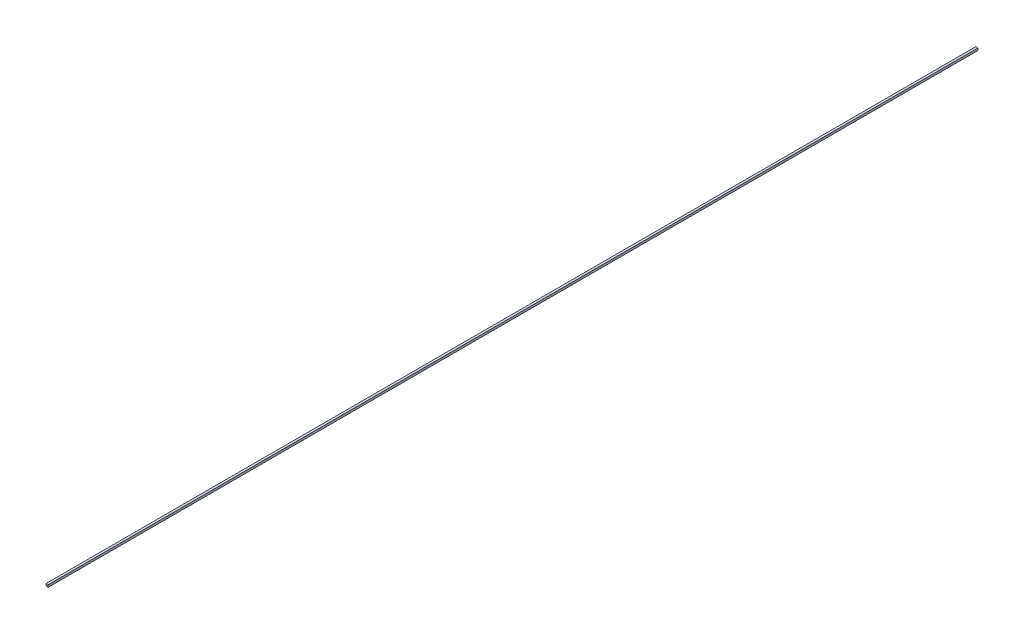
ISO-10303-21;
HEADER;
FILE_DESCRIPTION(('STEP AP214'),'2;1');
FILE_NAME('part.step','',(''),(''),'','','');
FILE_SCHEMA(('AUTOMOTIVE_DESIGN { 1 0 10303 214 1 1 1 1 }'));
ENDSEC;
DATA;
#1=APPLICATION_CONTEXT('core data for automotive mechanical design processes');
#2=APPLICATION_PROTOCOL_DEFINITION('international standard','automotive_design',2000,#1);
#3=PRODUCT_CONTEXT('',#1,'mechanical');
#4=PRODUCT('Part','Part','',(#3));
#5=PRODUCT_RELATED_PRODUCT_CATEGORY('part','',(#4));
#6=PRODUCT_DEFINITION_FORMATION('','',#4);
#7=PRODUCT_DEFINITION_CONTEXT('part definition',#1,'design');
#8=PRODUCT_DEFINITION('design','',#6,#7);
#9=PRODUCT_DEFINITION_SHAPE('','',#8);
#10=(LENGTH_UNIT() NAMED_UNIT(*) SI_UNIT(.MILLI.,.METRE.));
#11=(NAMED_UNIT(*) PLANE_ANGLE_UNIT() SI_UNIT($,.RADIAN.));
#12=(NAMED_UNIT(*) SI_UNIT($,.STERADIAN.) SOLID_ANGLE_UNIT());
#13=UNCERTAINTY_MEASURE_WITH_UNIT(LENGTH_MEASURE(1.E-05),#10,'distance_accuracy_value','');
#14=(GEOMETRIC_REPRESENTATION_CONTEXT(3) GLOBAL_UNCERTAINTY_ASSIGNED_CONTEXT((#13)) GLOBAL_UNIT_ASSIGNED_CONTEXT((#10,
#11,#12)) REPRESENTATION_CONTEXT('',''));
#15=CARTESIAN_POINT('',(0.,0.,0.));
#16=DIRECTION('',(0.,0.,1.));
#17=DIRECTION('',(1.,0.,0.));
#18=AXIS2_PLACEMENT_3D('',#15,#16,#17);
#19=CARTESIAN_POINT('',(0.00100076,0.00100076,0.));
#20=DIRECTION('',(1.,0.,0.));
#21=DIRECTION('',(0.,0.,-1.));
#22=AXIS2_PLACEMENT_3D('',#19,#20,#21);
#23=PLANE('',#22);
#24=DIRECTION('',(0.,0.,-1.));
#25=VECTOR('',#24,1.);
#26=CARTESIAN_POINT('',(0.00100076,0.,0.));
#27=LINE('',#26,#25);
#28=CARTESIAN_POINT('',(0.00100076,0.,0.));
#29=VERTEX_POINT('',#28);
#30=CARTESIAN_POINT('',(0.00100076,0.,0.41656));
#31=VERTEX_POINT('',#30);
#32=EDGE_CURVE('E61',#29,#31,#27,.F.);
#33=ORIENTED_EDGE('',*,*,#32,.F.);
#34=DIRECTION('',(0.,1.,0.));
#35=VECTOR('',#34,1.);
#36=CARTESIAN_POINT('',(0.00100076,0.00100076,0.));
#37=LINE('',#36,#35);
#38=CARTESIAN_POINT('',(0.00100076,0.00100076,0.));
#39=VERTEX_POINT('',#38);
#40=EDGE_CURVE('E75',#29,#39,#37,.T.);
#41=ORIENTED_EDGE('',*,*,#40,.T.);
#42=DIRECTION('',(0.,0.,1.));
#43=VECTOR('',#42,1.);
#44=CARTESIAN_POINT('',(0.00100076,0.00100076,0.));
#45=LINE('',#44,#43);
#46=CARTESIAN_POINT('',(0.00100076,0.00100076,0.41656));
#47=VERTEX_POINT('',#46);
#48=EDGE_CURVE('E79',#47,#39,#45,.F.);
#49=ORIENTED_EDGE('',*,*,#48,.F.);
#50=DIRECTION('',(0.,1.,0.));
#51=VECTOR('',#50,1.);
#52=CARTESIAN_POINT('',(0.00100076,0.,0.41656));
#53=LINE('',#52,#51);
#54=EDGE_CURVE('E64',#31,#47,#53,.T.);
#55=ORIENTED_EDGE('',*,*,#54,.F.);
#56=EDGE_LOOP('',(#33,#41,#49,#55));
#57=FACE_BOUND('',#56,.T.);
#58=ADVANCED_FACE('F16',(#57),#23,.T.);
#59=CARTESIAN_POINT('',(0.00100076,0.,0.));
#60=DIRECTION('',(0.,-1.,0.));
#61=DIRECTION('',(0.,0.,-1.));
#62=AXIS2_PLACEMENT_3D('',#59,#60,#61);
#63=PLANE('',#62);
#64=DIRECTION('',(0.,0.,1.));
#65=VECTOR('',#64,1.);
#66=CARTESIAN_POINT('',(0.,0.,0.));
#67=LINE('',#66,#65);
#68=CARTESIAN_POINT('',(0.,0.,0.));
#69=VERTEX_POINT('',#68);
#70=CARTESIAN_POINT('',(0.,0.,0.41656));
#71=VERTEX_POINT('',#70);
#72=EDGE_CURVE('E59',#69,#71,#67,.T.);
#73=ORIENTED_EDGE('',*,*,#72,.F.);
#74=DIRECTION('',(1.,0.,0.));
#75=VECTOR('',#74,1.);
#76=CARTESIAN_POINT('',(0.00100076,0.,0.));
#77=LINE('',#76,#75);
#78=EDGE_CURVE('E81',#69,#29,#77,.T.);
#79=ORIENTED_EDGE('',*,*,#78,.T.);
#80=ORIENTED_EDGE('',*,*,#32,.T.);
#81=DIRECTION('',(1.,0.,0.));
#82=VECTOR('',#81,1.);
#83=CARTESIAN_POINT('',(0.,0.,0.41656));
#84=LINE('',#83,#82);
#85=EDGE_CURVE('E19',#71,#31,#84,.T.);
#86=ORIENTED_EDGE('',*,*,#85,.F.);
#87=EDGE_LOOP('',(#73,#79,#80,#86));
#88=FACE_BOUND('',#87,.T.);
#89=ADVANCED_FACE('F56',(#88),#63,.T.);
#90=CARTESIAN_POINT('',(0.,0.,0.41656));
#91=DIRECTION('',(0.,0.,1.));
#92=DIRECTION('',(1.,0.,0.));
#93=AXIS2_PLACEMENT_3D('',#90,#91,#92);
#94=PLANE('',#93);
#95=DIRECTION('',(1.,0.,0.));
#96=VECTOR('',#95,1.);
#97=CARTESIAN_POINT('',(0.,0.00100076,0.41656));
#98=LINE('',#97,#96);
#99=CARTESIAN_POINT('',(0.,0.00100076,0.41656));
#100=VERTEX_POINT('',#99);
#101=EDGE_CURVE('E69',#100,#47,#98,.T.);
#102=ORIENTED_EDGE('',*,*,#101,.F.);
#103=DIRECTION('',(0.,1.,0.));
#104=VECTOR('',#103,1.);
#105=CARTESIAN_POINT('',(0.,0.,0.41656));
#106=LINE('',#105,#104);
#107=EDGE_CURVE('E66',#71,#100,#106,.T.);
#108=ORIENTED_EDGE('',*,*,#107,.F.);
#109=ORIENTED_EDGE('',*,*,#85,.T.);
#110=ORIENTED_EDGE('',*,*,#54,.T.);
#111=EDGE_LOOP('',(#102,#108,#109,#110));
#112=FACE_BOUND('',#111,.T.);
#113=ADVANCED_FACE('F67',(#112),#94,.T.);
#114=CARTESIAN_POINT('',(0.,0.00100076,0.));
#115=DIRECTION('',(0.,1.,0.));
#116=DIRECTION('',(0.,0.,1.));
#117=AXIS2_PLACEMENT_3D('',#114,#115,#116);
#118=PLANE('',#117);
#119=ORIENTED_EDGE('',*,*,#48,.T.);
#120=DIRECTION('',(1.,0.,0.));
#121=VECTOR('',#120,1.);
#122=CARTESIAN_POINT('',(0.,0.00100076,0.));
#123=LINE('',#122,#121);
#124=CARTESIAN_POINT('',(0.,0.00100076,0.));
#125=VERTEX_POINT('',#124);
#126=EDGE_CURVE('E34',#39,#125,#123,.F.);
#127=ORIENTED_EDGE('',*,*,#126,.T.);
#128=DIRECTION('',(0.,0.,1.));
#129=VECTOR('',#128,1.);
#130=CARTESIAN_POINT('',(0.,0.00100076,0.));
#131=LINE('',#130,#129);
#132=EDGE_CURVE('E25',#100,#125,#131,.F.);
#133=ORIENTED_EDGE('',*,*,#132,.F.);
#134=ORIENTED_EDGE('',*,*,#101,.T.);
#135=EDGE_LOOP('',(#119,#127,#133,#134));
#136=FACE_BOUND('',#135,.T.);
#137=ADVANCED_FACE('F88',(#136),#118,.T.);
#138=CARTESIAN_POINT('',(0.,0.,0.));
#139=DIRECTION('',(0.,0.,1.));
#140=DIRECTION('',(1.,0.,0.));
#141=AXIS2_PLACEMENT_3D('',#138,#139,#140);
#142=PLANE('',#141);
#143=ORIENTED_EDGE('',*,*,#126,.F.);
#144=ORIENTED_EDGE('',*,*,#40,.F.);
#145=ORIENTED_EDGE('',*,*,#78,.F.);
#146=DIRECTION('',(0.,1.,0.));
#147=VECTOR('',#146,1.);
#148=CARTESIAN_POINT('',(0.,0.,0.));
#149=LINE('',#148,#147);
#150=EDGE_CURVE('E10',#125,#69,#149,.F.);
#151=ORIENTED_EDGE('',*,*,#150,.F.);
#152=EDGE_LOOP('',(#143,#144,#145,#151));
#153=FACE_BOUND('',#152,.T.);
#154=ADVANCED_FACE('F90',(#153),#142,.F.);
#155=CARTESIAN_POINT('',(0.,0.,0.));
#156=DIRECTION('',(-1.,0.,0.));
#157=DIRECTION('',(0.,0.,1.));
#158=AXIS2_PLACEMENT_3D('',#155,#156,#157);
#159=PLANE('',#158);
#160=ORIENTED_EDGE('',*,*,#132,.T.);
#161=ORIENTED_EDGE('',*,*,#150,.T.);
#162=ORIENTED_EDGE('',*,*,#72,.T.);
#163=ORIENTED_EDGE('',*,*,#107,.T.);
#164=EDGE_LOOP('',(#160,#161,#162,#163));
#165=FACE_BOUND('',#164,.T.);
#166=ADVANCED_FACE('F73',(#165),#159,.T.);
#167=CLOSED_SHELL('',(#58,#89,#113,#137,#154,#166));
#168=MANIFOLD_SOLID_BREP('B1',#167);
#169=ADVANCED_BREP_SHAPE_REPRESENTATION('',(#18,#168),#14);
#170=SHAPE_DEFINITION_REPRESENTATION(#9,#169);
ENDSEC;
END-ISO-10303-21;
